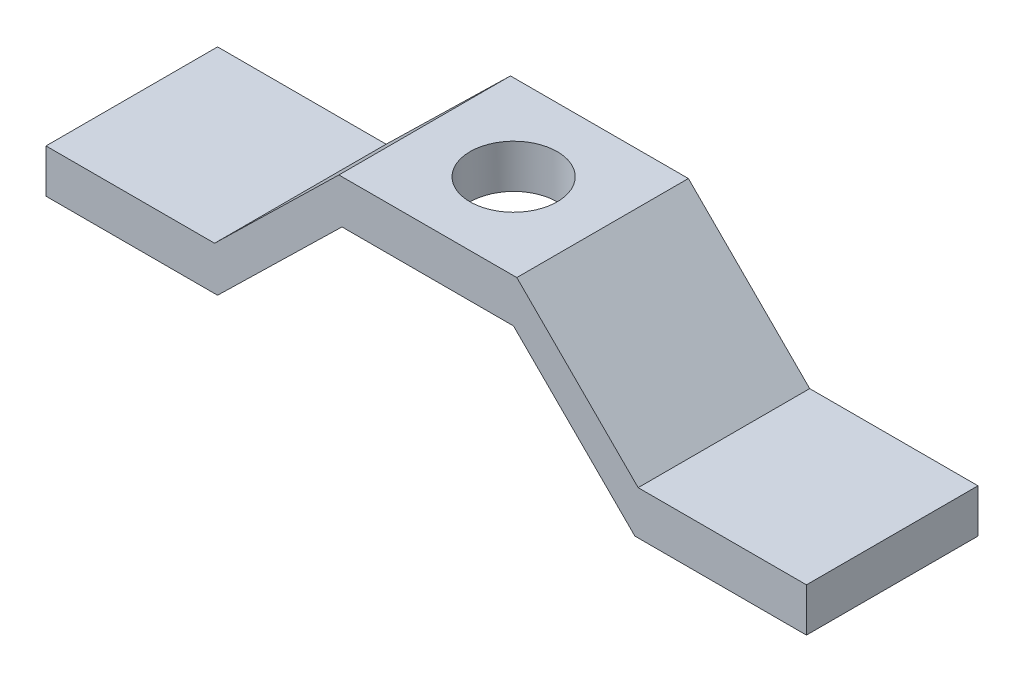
ISO-10303-21;
HEADER;
FILE_DESCRIPTION(('STEP AP214'),'2;1');
FILE_NAME('part.step','',(''),(''),'','','');
FILE_SCHEMA(('AUTOMOTIVE_DESIGN { 1 0 10303 214 1 1 1 1 }'));
ENDSEC;
DATA;
#1=APPLICATION_CONTEXT('core data for automotive mechanical design processes');
#2=APPLICATION_PROTOCOL_DEFINITION('international standard','automotive_design',2000,#1);
#3=PRODUCT_CONTEXT('',#1,'mechanical');
#4=PRODUCT('Part','Part','',(#3));
#5=PRODUCT_RELATED_PRODUCT_CATEGORY('part','',(#4));
#6=PRODUCT_DEFINITION_FORMATION('','',#4);
#7=PRODUCT_DEFINITION_CONTEXT('part definition',#1,'design');
#8=PRODUCT_DEFINITION('design','',#6,#7);
#9=PRODUCT_DEFINITION_SHAPE('','',#8);
#10=(LENGTH_UNIT() NAMED_UNIT(*) SI_UNIT(.MILLI.,.METRE.));
#11=(NAMED_UNIT(*) PLANE_ANGLE_UNIT() SI_UNIT($,.RADIAN.));
#12=(NAMED_UNIT(*) SI_UNIT($,.STERADIAN.) SOLID_ANGLE_UNIT());
#13=UNCERTAINTY_MEASURE_WITH_UNIT(LENGTH_MEASURE(1.E-05),#10,'distance_accuracy_value','');
#14=(GEOMETRIC_REPRESENTATION_CONTEXT(3) GLOBAL_UNCERTAINTY_ASSIGNED_CONTEXT((#13)) GLOBAL_UNIT_ASSIGNED_CONTEXT((#10,
#11,#12)) REPRESENTATION_CONTEXT('',''));
#15=CARTESIAN_POINT('',(0.,0.,0.));
#16=DIRECTION('',(0.,0.,1.));
#17=DIRECTION('',(1.,0.,0.));
#18=AXIS2_PLACEMENT_3D('',#15,#16,#17);
#19=CARTESIAN_POINT('',(-65.4765100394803,-48.8035232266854,20.));
#20=DIRECTION('',(-0.698336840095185,0.715769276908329,0.));
#21=DIRECTION('',(-0.715769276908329,-0.698336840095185,0.));
#22=AXIS2_PLACEMENT_3D('',#19,#20,#21);
#23=PLANE('',#22);
#24=DIRECTION('',(0.715769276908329,0.698336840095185,0.));
#25=VECTOR('',#24,1.);
#26=CARTESIAN_POINT('',(-65.4765100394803,-48.8035232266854,0.));
#27=LINE('',#26,#25);
#28=CARTESIAN_POINT('',(-65.4765100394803,-48.8035232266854,0.));
#29=VERTEX_POINT('',#28);
#30=CARTESIAN_POINT('',(-50.9703041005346,-34.6506134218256,0.));
#31=VERTEX_POINT('',#30);
#32=EDGE_CURVE('E152',#29,#31,#27,.T.);
#33=ORIENTED_EDGE('',*,*,#32,.T.);
#34=DIRECTION('',(0.,0.,-1.));
#35=VECTOR('',#34,1.);
#36=CARTESIAN_POINT('',(-50.9703041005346,-34.6506134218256,20.));
#37=LINE('',#36,#35);
#38=CARTESIAN_POINT('',(-50.9703041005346,-34.6506134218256,20.));
#39=VERTEX_POINT('',#38);
#40=EDGE_CURVE('E11',#39,#31,#37,.T.);
#41=ORIENTED_EDGE('',*,*,#40,.F.);
#42=DIRECTION('',(0.715769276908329,0.698336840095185,0.));
#43=VECTOR('',#42,1.);
#44=CARTESIAN_POINT('',(-65.4765100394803,-48.8035232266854,20.));
#45=LINE('',#44,#43);
#46=CARTESIAN_POINT('',(-65.4765100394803,-48.8035232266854,20.));
#47=VERTEX_POINT('',#46);
#48=EDGE_CURVE('E181',#47,#39,#45,.T.);
#49=ORIENTED_EDGE('',*,*,#48,.F.);
#50=DIRECTION('',(0.,0.,-1.));
#51=VECTOR('',#50,1.);
#52=CARTESIAN_POINT('',(-65.4765100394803,-48.8035232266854,20.));
#53=LINE('',#52,#51);
#54=EDGE_CURVE('E148',#47,#29,#53,.T.);
#55=ORIENTED_EDGE('',*,*,#54,.T.);
#56=EDGE_LOOP('',(#33,#41,#49,#55));
#57=FACE_BOUND('',#56,.T.);
#58=ADVANCED_FACE('F33',(#57),#23,.F.);
#59=CARTESIAN_POINT('',(-50.9703041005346,-34.6506134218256,20.));
#60=DIRECTION('',(0.,1.,0.));
#61=DIRECTION('',(-1.,0.,0.));
#62=AXIS2_PLACEMENT_3D('',#59,#60,#61);
#63=PLANE('',#62);
#64=CARTESIAN_POINT('',(-40.9575504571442,-34.6506134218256,10.));
#65=DIRECTION('',(0.,1.,0.));
#66=DIRECTION('',(-1.,0.,0.));
#67=AXIS2_PLACEMENT_3D('',#64,#65,#66);
#68=ELLIPSE('',#67,5.08000098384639,5.08000000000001);
#69=CARTESIAN_POINT('',(-46.0375514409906,-34.6506134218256,10.));
#70=VERTEX_POINT('',#69);
#71=EDGE_CURVE('E156',#70,#70,#68,.T.);
#72=ORIENTED_EDGE('',*,*,#71,.T.);
#73=EDGE_LOOP('',(#72));
#74=FACE_BOUND('',#73,.T.);
#75=DIRECTION('',(1.,0.,0.));
#76=VECTOR('',#75,1.);
#77=CARTESIAN_POINT('',(-50.9703041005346,-34.6506134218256,0.));
#78=LINE('',#77,#76);
#79=CARTESIAN_POINT('',(-30.9703041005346,-34.6506134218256,0.));
#80=VERTEX_POINT('',#79);
#81=EDGE_CURVE('E155',#31,#80,#78,.T.);
#82=ORIENTED_EDGE('',*,*,#81,.T.);
#83=DIRECTION('',(0.,0.,-1.));
#84=VECTOR('',#83,1.);
#85=CARTESIAN_POINT('',(-30.9703041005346,-34.6506134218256,20.));
#86=LINE('',#85,#84);
#87=CARTESIAN_POINT('',(-30.9703041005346,-34.6506134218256,20.));
#88=VERTEX_POINT('',#87);
#89=EDGE_CURVE('E41',#88,#80,#86,.T.);
#90=ORIENTED_EDGE('',*,*,#89,.F.);
#91=DIRECTION('',(1.,0.,0.));
#92=VECTOR('',#91,1.);
#93=CARTESIAN_POINT('',(-50.9703041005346,-34.6506134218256,20.));
#94=LINE('',#93,#92);
#95=EDGE_CURVE('E100',#39,#88,#94,.T.);
#96=ORIENTED_EDGE('',*,*,#95,.F.);
#97=ORIENTED_EDGE('',*,*,#40,.T.);
#98=EDGE_LOOP('',(#82,#90,#96,#97));
#99=FACE_BOUND('',#98,.T.);
#100=ADVANCED_FACE('F251',(#74,#99),#63,.F.);
#101=CARTESIAN_POINT('',(-30.9703041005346,-34.6506134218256,20.));
#102=DIRECTION('',(0.707,0.707213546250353,0.));
#103=DIRECTION('',(-0.707213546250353,0.707,0.));
#104=AXIS2_PLACEMENT_3D('',#101,#102,#103);
#105=PLANE('',#104);
#106=DIRECTION('',(0.707213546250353,-0.707,0.));
#107=VECTOR('',#106,1.);
#108=CARTESIAN_POINT('',(-30.9703041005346,-34.6506134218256,0.));
#109=LINE('',#108,#107);
#110=CARTESIAN_POINT('',(-16.8260331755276,-48.7906134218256,0.));
#111=VERTEX_POINT('',#110);
#112=EDGE_CURVE('E158',#80,#111,#109,.T.);
#113=ORIENTED_EDGE('',*,*,#112,.T.);
#114=DIRECTION('',(0.,0.,-1.));
#115=VECTOR('',#114,1.);
#116=CARTESIAN_POINT('',(-16.8260331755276,-48.7906134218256,20.));
#117=LINE('',#116,#115);
#118=CARTESIAN_POINT('',(-16.8260331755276,-48.7906134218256,20.));
#119=VERTEX_POINT('',#118);
#120=EDGE_CURVE('E196',#119,#111,#117,.T.);
#121=ORIENTED_EDGE('',*,*,#120,.F.);
#122=DIRECTION('',(0.707213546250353,-0.707,0.));
#123=VECTOR('',#122,1.);
#124=CARTESIAN_POINT('',(-30.9703041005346,-34.6506134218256,20.));
#125=LINE('',#124,#123);
#126=EDGE_CURVE('E204',#88,#119,#125,.T.);
#127=ORIENTED_EDGE('',*,*,#126,.F.);
#128=ORIENTED_EDGE('',*,*,#89,.T.);
#129=EDGE_LOOP('',(#113,#121,#127,#128));
#130=FACE_BOUND('',#129,.T.);
#131=ADVANCED_FACE('F202',(#130),#105,.F.);
#132=CARTESIAN_POINT('',(-16.8260331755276,-48.7906134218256,20.));
#133=DIRECTION('',(0.,1.,0.));
#134=DIRECTION('',(-1.,0.,0.));
#135=AXIS2_PLACEMENT_3D('',#132,#133,#134);
#136=PLANE('',#135);
#137=DIRECTION('',(1.,0.,0.));
#138=VECTOR('',#137,1.);
#139=CARTESIAN_POINT('',(-16.8260331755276,-48.7906134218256,0.));
#140=LINE('',#139,#138);
#141=CARTESIAN_POINT('',(3.17396682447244,-48.7906134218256,0.));
#142=VERTEX_POINT('',#141);
#143=EDGE_CURVE('E160',#111,#142,#140,.T.);
#144=ORIENTED_EDGE('',*,*,#143,.T.);
#145=DIRECTION('',(0.,0.,-1.));
#146=VECTOR('',#145,1.);
#147=CARTESIAN_POINT('',(3.17396682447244,-48.7906134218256,20.));
#148=LINE('',#147,#146);
#149=CARTESIAN_POINT('',(3.17396682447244,-48.7906134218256,20.));
#150=VERTEX_POINT('',#149);
#151=EDGE_CURVE('E193',#150,#142,#148,.T.);
#152=ORIENTED_EDGE('',*,*,#151,.F.);
#153=DIRECTION('',(1.,0.,0.));
#154=VECTOR('',#153,1.);
#155=CARTESIAN_POINT('',(-16.8260331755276,-48.7906134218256,20.));
#156=LINE('',#155,#154);
#157=EDGE_CURVE('E222',#119,#150,#156,.T.);
#158=ORIENTED_EDGE('',*,*,#157,.F.);
#159=ORIENTED_EDGE('',*,*,#120,.T.);
#160=EDGE_LOOP('',(#144,#152,#158,#159));
#161=FACE_BOUND('',#160,.T.);
#162=ADVANCED_FACE('F212',(#161),#136,.F.);
#163=CARTESIAN_POINT('',(3.17396682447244,-48.7906134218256,20.));
#164=DIRECTION('',(-1.,0.,0.));
#165=DIRECTION('',(0.,0.,1.));
#166=AXIS2_PLACEMENT_3D('',#163,#164,#165);
#167=PLANE('',#166);
#168=DIRECTION('',(0.,1.,0.));
#169=VECTOR('',#168,1.);
#170=CARTESIAN_POINT('',(3.17396682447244,-48.7906134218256,0.));
#171=LINE('',#170,#169);
#172=CARTESIAN_POINT('',(3.17396682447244,-43.7106134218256,0.));
#173=VERTEX_POINT('',#172);
#174=EDGE_CURVE('E162',#142,#173,#171,.T.);
#175=ORIENTED_EDGE('',*,*,#174,.T.);
#176=DIRECTION('',(0.,0.,-1.));
#177=VECTOR('',#176,1.);
#178=CARTESIAN_POINT('',(3.17396682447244,-43.7106134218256,20.));
#179=LINE('',#178,#177);
#180=CARTESIAN_POINT('',(3.17396682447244,-43.7106134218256,20.));
#181=VERTEX_POINT('',#180);
#182=EDGE_CURVE('E191',#181,#173,#179,.T.);
#183=ORIENTED_EDGE('',*,*,#182,.F.);
#184=DIRECTION('',(0.,1.,0.));
#185=VECTOR('',#184,1.);
#186=CARTESIAN_POINT('',(3.17396682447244,-48.7906134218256,20.));
#187=LINE('',#186,#185);
#188=EDGE_CURVE('E218',#150,#181,#187,.T.);
#189=ORIENTED_EDGE('',*,*,#188,.F.);
#190=ORIENTED_EDGE('',*,*,#151,.T.);
#191=EDGE_LOOP('',(#175,#183,#189,#190));
#192=FACE_BOUND('',#191,.T.);
#193=ADVANCED_FACE('F216',(#192),#167,.F.);
#194=CARTESIAN_POINT('',(-16.4449060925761,-43.7106134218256,20.));
#195=DIRECTION('',(0.,1.,0.));
#196=DIRECTION('',(0.,0.,1.));
#197=AXIS2_PLACEMENT_3D('',#194,#195,#196);
#198=PLANE('',#197);
#199=DIRECTION('',(1.,0.,0.));
#200=VECTOR('',#199,1.);
#201=CARTESIAN_POINT('',(-16.4449060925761,-43.7106134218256,0.));
#202=LINE('',#201,#200);
#203=CARTESIAN_POINT('',(-16.4449060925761,-43.7106134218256,0.));
#204=VERTEX_POINT('',#203);
#205=EDGE_CURVE('E165',#204,#173,#202,.T.);
#206=ORIENTED_EDGE('',*,*,#205,.F.);
#207=DIRECTION('',(0.,0.,-1.));
#208=VECTOR('',#207,1.);
#209=CARTESIAN_POINT('',(-16.4449060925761,-43.7106134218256,20.));
#210=LINE('',#209,#208);
#211=CARTESIAN_POINT('',(-16.4449060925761,-43.7106134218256,20.));
#212=VERTEX_POINT('',#211);
#213=EDGE_CURVE('E189',#212,#204,#210,.T.);
#214=ORIENTED_EDGE('',*,*,#213,.F.);
#215=DIRECTION('',(1.,0.,0.));
#216=VECTOR('',#215,1.);
#217=CARTESIAN_POINT('',(-16.4449060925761,-43.7106134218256,20.));
#218=LINE('',#217,#216);
#219=EDGE_CURVE('E221',#212,#181,#218,.T.);
#220=ORIENTED_EDGE('',*,*,#219,.T.);
#221=ORIENTED_EDGE('',*,*,#182,.T.);
#222=EDGE_LOOP('',(#206,#214,#220,#221));
#223=FACE_BOUND('',#222,.T.);
#224=ADVANCED_FACE('F266',(#223),#198,.T.);
#225=CARTESIAN_POINT('',(-30.5891770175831,-29.5706134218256,20.));
#226=DIRECTION('',(0.707,0.707213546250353,0.));
#227=DIRECTION('',(-0.707213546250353,0.707,0.));
#228=AXIS2_PLACEMENT_3D('',#225,#226,#227);
#229=PLANE('',#228);
#230=DIRECTION('',(0.707213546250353,-0.707,0.));
#231=VECTOR('',#230,1.);
#232=CARTESIAN_POINT('',(-30.5891770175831,-29.5706134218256,0.));
#233=LINE('',#232,#231);
#234=CARTESIAN_POINT('',(-30.5891770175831,-29.5706134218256,0.));
#235=VERTEX_POINT('',#234);
#236=EDGE_CURVE('E168',#235,#204,#233,.T.);
#237=ORIENTED_EDGE('',*,*,#236,.F.);
#238=DIRECTION('',(0.,0.,-1.));
#239=VECTOR('',#238,1.);
#240=CARTESIAN_POINT('',(-30.5891770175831,-29.5706134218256,20.));
#241=LINE('',#240,#239);
#242=CARTESIAN_POINT('',(-30.5891770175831,-29.5706134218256,20.));
#243=VERTEX_POINT('',#242);
#244=EDGE_CURVE('E187',#243,#235,#241,.T.);
#245=ORIENTED_EDGE('',*,*,#244,.F.);
#246=DIRECTION('',(0.707213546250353,-0.707,0.));
#247=VECTOR('',#246,1.);
#248=CARTESIAN_POINT('',(-30.5891770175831,-29.5706134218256,20.));
#249=LINE('',#248,#247);
#250=EDGE_CURVE('E224',#243,#212,#249,.T.);
#251=ORIENTED_EDGE('',*,*,#250,.T.);
#252=ORIENTED_EDGE('',*,*,#213,.T.);
#253=EDGE_LOOP('',(#237,#245,#251,#252));
#254=FACE_BOUND('',#253,.T.);
#255=ADVANCED_FACE('F269',(#254),#229,.T.);
#256=CARTESIAN_POINT('',(-51.3322391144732,-29.5835232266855,20.));
#257=DIRECTION('',(-0.000622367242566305,0.999999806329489,0.));
#258=DIRECTION('',(-0.999999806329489,-0.000622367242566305,0.));
#259=AXIS2_PLACEMENT_3D('',#256,#257,#258);
#260=PLANE('',#259);
#261=CARTESIAN_POINT('',(-40.9607080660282,-29.5770683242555,10.));
#262=DIRECTION('',(-0.000622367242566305,0.999999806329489,0.));
#263=DIRECTION('',(-0.999999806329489,-0.000622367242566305,0.));
#264=AXIS2_PLACEMENT_3D('',#261,#262,#263);
#265=CIRCLE('',#264,5.08000000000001);
#266=CARTESIAN_POINT('',(-46.040707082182,-29.5802299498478,10.));
#267=VERTEX_POINT('',#266);
#268=EDGE_CURVE('E337',#267,#267,#265,.T.);
#269=ORIENTED_EDGE('',*,*,#268,.F.);
#270=EDGE_LOOP('',(#269));
#271=FACE_BOUND('',#270,.T.);
#272=DIRECTION('',(0.999999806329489,0.000622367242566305,0.));
#273=VECTOR('',#272,1.);
#274=CARTESIAN_POINT('',(-51.3322391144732,-29.5835232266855,0.));
#275=LINE('',#274,#273);
#276=CARTESIAN_POINT('',(-51.3322391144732,-29.5835232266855,0.));
#277=VERTEX_POINT('',#276);
#278=EDGE_CURVE('E171',#277,#235,#275,.T.);
#279=ORIENTED_EDGE('',*,*,#278,.F.);
#280=DIRECTION('',(0.,0.,-1.));
#281=VECTOR('',#280,1.);
#282=CARTESIAN_POINT('',(-51.3322391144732,-29.5835232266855,20.));
#283=LINE('',#282,#281);
#284=CARTESIAN_POINT('',(-51.3322391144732,-29.5835232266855,20.));
#285=VERTEX_POINT('',#284);
#286=EDGE_CURVE('E185',#285,#277,#283,.T.);
#287=ORIENTED_EDGE('',*,*,#286,.F.);
#288=DIRECTION('',(0.999999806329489,0.000622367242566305,0.));
#289=VECTOR('',#288,1.);
#290=CARTESIAN_POINT('',(-51.3322391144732,-29.5835232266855,20.));
#291=LINE('',#290,#289);
#292=EDGE_CURVE('E231',#285,#243,#291,.T.);
#293=ORIENTED_EDGE('',*,*,#292,.T.);
#294=ORIENTED_EDGE('',*,*,#244,.T.);
#295=EDGE_LOOP('',(#279,#287,#293,#294));
#296=FACE_BOUND('',#295,.T.);
#297=ADVANCED_FACE('F273',(#271,#296),#260,.T.);
#298=CARTESIAN_POINT('',(-65.8252129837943,-43.7235232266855,20.));
#299=DIRECTION('',(-0.698336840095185,0.715769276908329,0.));
#300=DIRECTION('',(-0.715769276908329,-0.698336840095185,0.));
#301=AXIS2_PLACEMENT_3D('',#298,#299,#300);
#302=PLANE('',#301);
#303=DIRECTION('',(0.715769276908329,0.698336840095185,0.));
#304=VECTOR('',#303,1.);
#305=CARTESIAN_POINT('',(-65.8252129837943,-43.7235232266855,0.));
#306=LINE('',#305,#304);
#307=CARTESIAN_POINT('',(-65.8252129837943,-43.7235232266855,0.));
#308=VERTEX_POINT('',#307);
#309=EDGE_CURVE('E174',#308,#277,#306,.T.);
#310=ORIENTED_EDGE('',*,*,#309,.F.);
#311=DIRECTION('',(0.,0.,-1.));
#312=VECTOR('',#311,1.);
#313=CARTESIAN_POINT('',(-65.8252129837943,-43.7235232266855,20.));
#314=LINE('',#313,#312);
#315=CARTESIAN_POINT('',(-65.8252129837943,-43.7235232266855,20.));
#316=VERTEX_POINT('',#315);
#317=EDGE_CURVE('E137',#316,#308,#314,.T.);
#318=ORIENTED_EDGE('',*,*,#317,.F.);
#319=DIRECTION('',(0.715769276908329,0.698336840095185,0.));
#320=VECTOR('',#319,1.);
#321=CARTESIAN_POINT('',(-65.8252129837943,-43.7235232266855,20.));
#322=LINE('',#321,#320);
#323=EDGE_CURVE('E144',#316,#285,#322,.T.);
#324=ORIENTED_EDGE('',*,*,#323,.T.);
#325=ORIENTED_EDGE('',*,*,#286,.T.);
#326=EDGE_LOOP('',(#310,#318,#324,#325));
#327=FACE_BOUND('',#326,.T.);
#328=ADVANCED_FACE('F235',(#327),#302,.T.);
#329=CARTESIAN_POINT('',(-85.4765100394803,-43.7235232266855,20.));
#330=DIRECTION('',(0.,1.,0.));
#331=DIRECTION('',(0.,0.,1.));
#332=AXIS2_PLACEMENT_3D('',#329,#330,#331);
#333=PLANE('',#332);
#334=DIRECTION('',(1.,0.,0.));
#335=VECTOR('',#334,1.);
#336=CARTESIAN_POINT('',(-85.4765100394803,-43.7235232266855,0.));
#337=LINE('',#336,#335);
#338=CARTESIAN_POINT('',(-85.4765100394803,-43.7235232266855,0.));
#339=VERTEX_POINT('',#338);
#340=EDGE_CURVE('E132',#339,#308,#337,.T.);
#341=ORIENTED_EDGE('',*,*,#340,.F.);
#342=DIRECTION('',(0.,0.,-1.));
#343=VECTOR('',#342,1.);
#344=CARTESIAN_POINT('',(-85.4765100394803,-43.7235232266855,20.));
#345=LINE('',#344,#343);
#346=CARTESIAN_POINT('',(-85.4765100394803,-43.7235232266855,20.));
#347=VERTEX_POINT('',#346);
#348=EDGE_CURVE('E127',#347,#339,#345,.T.);
#349=ORIENTED_EDGE('',*,*,#348,.F.);
#350=DIRECTION('',(1.,0.,0.));
#351=VECTOR('',#350,1.);
#352=CARTESIAN_POINT('',(-85.4765100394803,-43.7235232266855,20.));
#353=LINE('',#352,#351);
#354=EDGE_CURVE('E130',#347,#316,#353,.T.);
#355=ORIENTED_EDGE('',*,*,#354,.T.);
#356=ORIENTED_EDGE('',*,*,#317,.T.);
#357=EDGE_LOOP('',(#341,#349,#355,#356));
#358=FACE_BOUND('',#357,.T.);
#359=ADVANCED_FACE('F129',(#358),#333,.T.);
#360=CARTESIAN_POINT('',(-85.4765100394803,-48.8035232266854,20.));
#361=DIRECTION('',(-1.,0.,0.));
#362=DIRECTION('',(0.,0.,1.));
#363=AXIS2_PLACEMENT_3D('',#360,#361,#362);
#364=PLANE('',#363);
#365=DIRECTION('',(0.,1.,0.));
#366=VECTOR('',#365,1.);
#367=CARTESIAN_POINT('',(-85.4765100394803,-48.8035232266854,0.));
#368=LINE('',#367,#366);
#369=CARTESIAN_POINT('',(-85.4765100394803,-48.8035232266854,0.));
#370=VERTEX_POINT('',#369);
#371=EDGE_CURVE('E178',#370,#339,#368,.T.);
#372=ORIENTED_EDGE('',*,*,#371,.F.);
#373=DIRECTION('',(0.,0.,-1.));
#374=VECTOR('',#373,1.);
#375=CARTESIAN_POINT('',(-85.4765100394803,-48.8035232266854,20.));
#376=LINE('',#375,#374);
#377=CARTESIAN_POINT('',(-85.4765100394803,-48.8035232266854,20.));
#378=VERTEX_POINT('',#377);
#379=EDGE_CURVE('E89',#378,#370,#376,.T.);
#380=ORIENTED_EDGE('',*,*,#379,.F.);
#381=DIRECTION('',(0.,1.,0.));
#382=VECTOR('',#381,1.);
#383=CARTESIAN_POINT('',(-85.4765100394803,-48.8035232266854,20.));
#384=LINE('',#383,#382);
#385=EDGE_CURVE('E141',#378,#347,#384,.T.);
#386=ORIENTED_EDGE('',*,*,#385,.T.);
#387=ORIENTED_EDGE('',*,*,#348,.T.);
#388=EDGE_LOOP('',(#372,#380,#386,#387));
#389=FACE_BOUND('',#388,.T.);
#390=ADVANCED_FACE('F146',(#389),#364,.T.);
#391=CARTESIAN_POINT('',(-85.4765100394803,-48.8035232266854,20.));
#392=DIRECTION('',(0.,1.,0.));
#393=DIRECTION('',(0.,0.,1.));
#394=AXIS2_PLACEMENT_3D('',#391,#392,#393);
#395=PLANE('',#394);
#396=DIRECTION('',(1.,0.,0.));
#397=VECTOR('',#396,1.);
#398=CARTESIAN_POINT('',(-85.4765100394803,-48.8035232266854,0.));
#399=LINE('',#398,#397);
#400=EDGE_CURVE('E92',#370,#29,#399,.T.);
#401=ORIENTED_EDGE('',*,*,#400,.T.);
#402=ORIENTED_EDGE('',*,*,#54,.F.);
#403=DIRECTION('',(1.,0.,0.));
#404=VECTOR('',#403,1.);
#405=CARTESIAN_POINT('',(-85.4765100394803,-48.8035232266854,20.));
#406=LINE('',#405,#404);
#407=EDGE_CURVE('E49',#378,#47,#406,.T.);
#408=ORIENTED_EDGE('',*,*,#407,.F.);
#409=ORIENTED_EDGE('',*,*,#379,.T.);
#410=EDGE_LOOP('',(#401,#402,#408,#409));
#411=FACE_BOUND('',#410,.T.);
#412=ADVANCED_FACE('F240',(#411),#395,.F.);
#413=CARTESIAN_POINT('',(0.,0.,20.));
#414=DIRECTION('',(0.,0.,-1.));
#415=DIRECTION('',(-1.,0.,0.));
#416=AXIS2_PLACEMENT_3D('',#413,#414,#415);
#417=PLANE('',#416);
#418=ORIENTED_EDGE('',*,*,#48,.T.);
#419=ORIENTED_EDGE('',*,*,#95,.T.);
#420=ORIENTED_EDGE('',*,*,#126,.T.);
#421=ORIENTED_EDGE('',*,*,#157,.T.);
#422=ORIENTED_EDGE('',*,*,#188,.T.);
#423=ORIENTED_EDGE('',*,*,#219,.F.);
#424=ORIENTED_EDGE('',*,*,#250,.F.);
#425=ORIENTED_EDGE('',*,*,#292,.F.);
#426=ORIENTED_EDGE('',*,*,#323,.F.);
#427=ORIENTED_EDGE('',*,*,#354,.F.);
#428=ORIENTED_EDGE('',*,*,#385,.F.);
#429=ORIENTED_EDGE('',*,*,#407,.T.);
#430=EDGE_LOOP('',(#418,#419,#420,#421,#422,#423,#424,#425,#426,#427,#428,#429));
#431=FACE_BOUND('',#430,.T.);
#432=ADVANCED_FACE('F140',(#431),#417,.F.);
#433=CARTESIAN_POINT('',(0.,0.,0.));
#434=DIRECTION('',(0.,0.,-1.));
#435=DIRECTION('',(-1.,0.,0.));
#436=AXIS2_PLACEMENT_3D('',#433,#434,#435);
#437=PLANE('',#436);
#438=ORIENTED_EDGE('',*,*,#32,.F.);
#439=ORIENTED_EDGE('',*,*,#400,.F.);
#440=ORIENTED_EDGE('',*,*,#371,.T.);
#441=ORIENTED_EDGE('',*,*,#340,.T.);
#442=ORIENTED_EDGE('',*,*,#309,.T.);
#443=ORIENTED_EDGE('',*,*,#278,.T.);
#444=ORIENTED_EDGE('',*,*,#236,.T.);
#445=ORIENTED_EDGE('',*,*,#205,.T.);
#446=ORIENTED_EDGE('',*,*,#174,.F.);
#447=ORIENTED_EDGE('',*,*,#143,.F.);
#448=ORIENTED_EDGE('',*,*,#112,.F.);
#449=ORIENTED_EDGE('',*,*,#81,.F.);
#450=EDGE_LOOP('',(#438,#439,#440,#441,#442,#443,#444,#445,#446,#447,#448,#449));
#451=FACE_BOUND('',#450,.T.);
#452=ADVANCED_FACE('F208',(#451),#437,.T.);
#453=CARTESIAN_POINT('',(-40.9575464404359,-34.6570673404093,10.));
#454=DIRECTION('',(-0.000622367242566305,0.999999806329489,0.));
#455=DIRECTION('',(-0.999999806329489,-0.000622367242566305,0.));
#456=AXIS2_PLACEMENT_3D('',#453,#454,#455);
#457=CYLINDRICAL_SURFACE('',#456,5.08000000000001);
#458=ORIENTED_EDGE('',*,*,#268,.T.);
#459=EDGE_LOOP('',(#458));
#460=FACE_BOUND('',#459,.T.);
#461=ORIENTED_EDGE('',*,*,#71,.F.);
#462=EDGE_LOOP('',(#461));
#463=FACE_BOUND('',#462,.T.);
#464=ADVANCED_FACE('F307',(#460,#463),#457,.F.);
#465=CLOSED_SHELL('',(#58,#100,#131,#162,#193,#224,#255,#297,#328,#359,#390,#412,#432,#452,#464));
#466=MANIFOLD_SOLID_BREP('B2',#465);
#467=ADVANCED_BREP_SHAPE_REPRESENTATION('',(#18,#466),#14);
#468=SHAPE_DEFINITION_REPRESENTATION(#9,#467);
ENDSEC;
END-ISO-10303-21;
